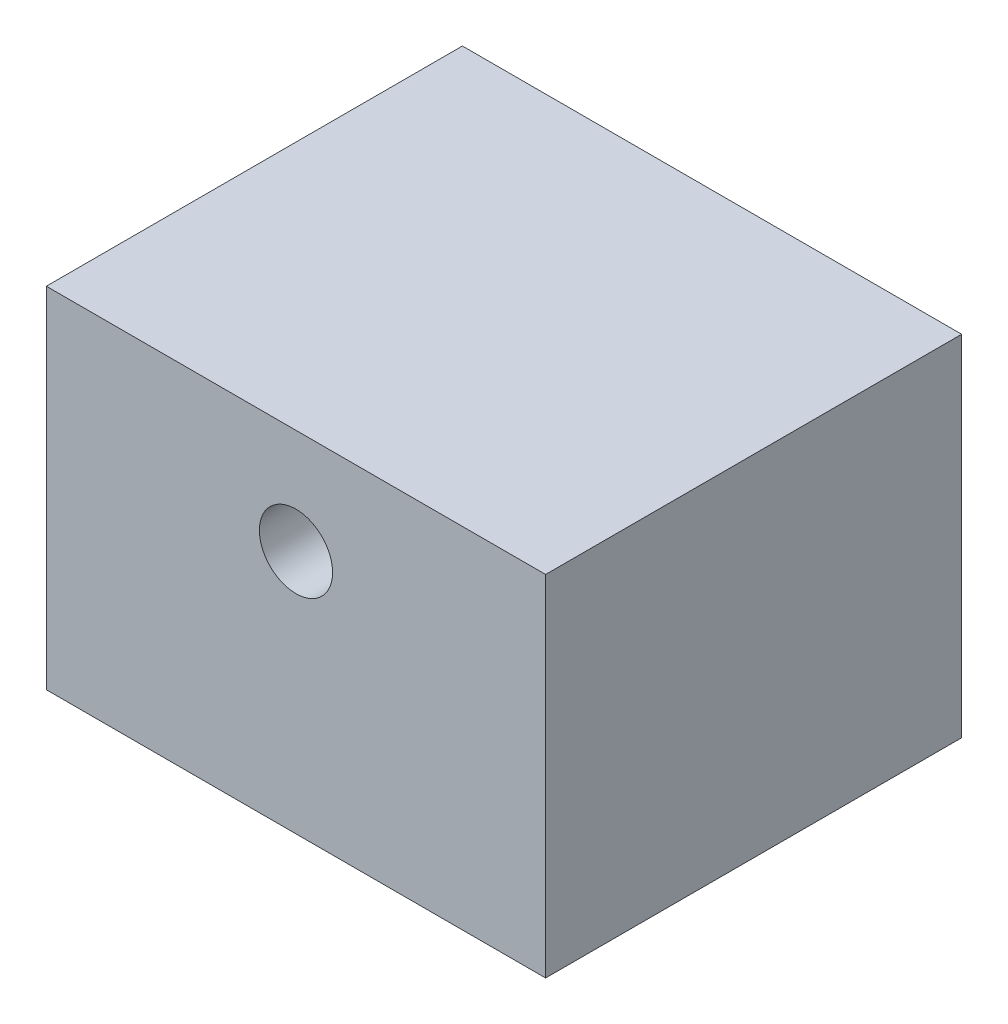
from build123d import *

# Parameters (mm, degrees)
SKETCH1_W           = 30
SKETCH1_H           = 21
SKETCH1_R           = 2.2
BOSS_EXTRUDE1_DEPTH = 12.5


with BuildPart() as part:
    # Sketch1 → Boss-Extrude1 (new, symmetric)
    with BuildSketch(Plane.XY):
        with Locations((15, 10.5)):
            Rectangle(SKETCH1_W, SKETCH1_H)
        with Locations((15, 14.7)):
            Circle(SKETCH1_R, mode=Mode.SUBTRACT)
    extrude(amount=BOSS_EXTRUDE1_DEPTH, both=True)


solid = part.part
